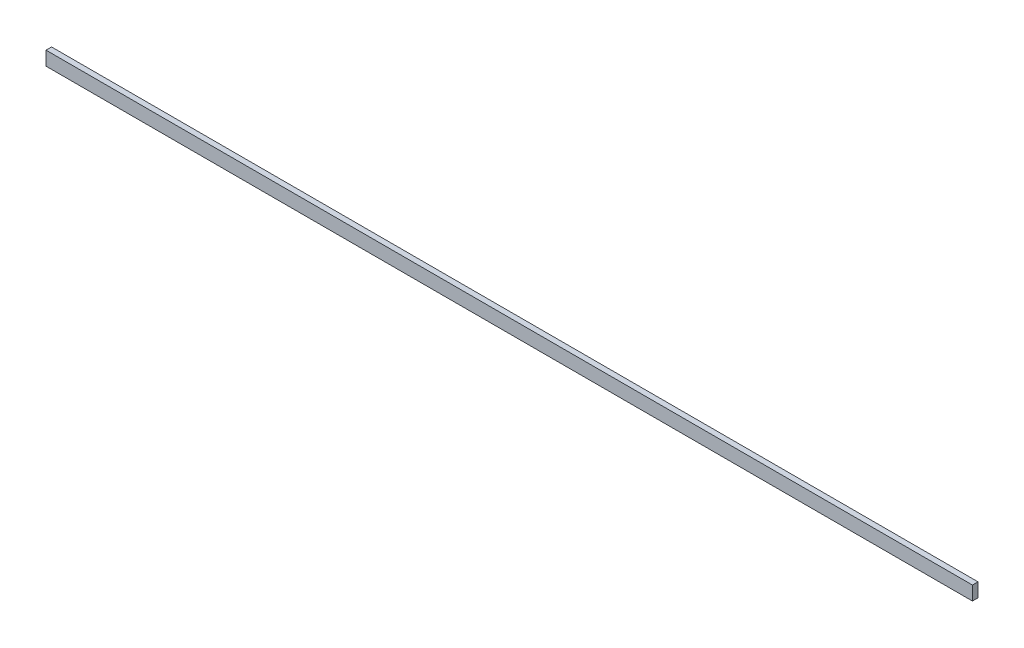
ISO-10303-21;
HEADER;
FILE_DESCRIPTION(('STEP AP214'),'2;1');
FILE_NAME('part.step','',(''),(''),'','','');
FILE_SCHEMA(('AUTOMOTIVE_DESIGN { 1 0 10303 214 1 1 1 1 }'));
ENDSEC;
DATA;
#1=APPLICATION_CONTEXT('core data for automotive mechanical design processes');
#2=APPLICATION_PROTOCOL_DEFINITION('international standard','automotive_design',2000,#1);
#3=PRODUCT_CONTEXT('',#1,'mechanical');
#4=PRODUCT('Part','Part','',(#3));
#5=PRODUCT_RELATED_PRODUCT_CATEGORY('part','',(#4));
#6=PRODUCT_DEFINITION_FORMATION('','',#4);
#7=PRODUCT_DEFINITION_CONTEXT('part definition',#1,'design');
#8=PRODUCT_DEFINITION('design','',#6,#7);
#9=PRODUCT_DEFINITION_SHAPE('','',#8);
#10=(LENGTH_UNIT() NAMED_UNIT(*) SI_UNIT(.MILLI.,.METRE.));
#11=(NAMED_UNIT(*) PLANE_ANGLE_UNIT() SI_UNIT($,.RADIAN.));
#12=(NAMED_UNIT(*) SI_UNIT($,.STERADIAN.) SOLID_ANGLE_UNIT());
#13=UNCERTAINTY_MEASURE_WITH_UNIT(LENGTH_MEASURE(1.E-05),#10,'distance_accuracy_value','');
#14=(GEOMETRIC_REPRESENTATION_CONTEXT(3) GLOBAL_UNCERTAINTY_ASSIGNED_CONTEXT((#13)) GLOBAL_UNIT_ASSIGNED_CONTEXT((#10,
#11,#12)) REPRESENTATION_CONTEXT('',''));
#15=CARTESIAN_POINT('',(0.,0.,0.));
#16=DIRECTION('',(0.,0.,1.));
#17=DIRECTION('',(1.,0.,0.));
#18=AXIS2_PLACEMENT_3D('',#15,#16,#17);
#19=CARTESIAN_POINT('',(0.,0.,12.));
#20=DIRECTION('',(1.,0.,0.));
#21=DIRECTION('',(0.,1.,0.));
#22=AXIS2_PLACEMENT_3D('',#19,#20,#21);
#23=PLANE('',#22);
#24=DIRECTION('',(0.,-1.,0.));
#25=VECTOR('',#24,1.);
#26=CARTESIAN_POINT('',(0.,0.,0.));
#27=LINE('',#26,#25);
#28=CARTESIAN_POINT('',(0.,0.,0.));
#29=VERTEX_POINT('',#28);
#30=CARTESIAN_POINT('',(0.,-30.,0.));
#31=VERTEX_POINT('',#30);
#32=EDGE_CURVE('E96',#29,#31,#27,.T.);
#33=ORIENTED_EDGE('',*,*,#32,.T.);
#34=DIRECTION('',(0.,0.,-1.));
#35=VECTOR('',#34,1.);
#36=CARTESIAN_POINT('',(0.,-30.,12.));
#37=LINE('',#36,#35);
#38=CARTESIAN_POINT('',(0.,-30.,12.));
#39=VERTEX_POINT('',#38);
#40=EDGE_CURVE('E11',#39,#31,#37,.T.);
#41=ORIENTED_EDGE('',*,*,#40,.F.);
#42=DIRECTION('',(0.,-1.,0.));
#43=VECTOR('',#42,1.);
#44=CARTESIAN_POINT('',(0.,0.,12.));
#45=LINE('',#44,#43);
#46=CARTESIAN_POINT('',(0.,0.,12.));
#47=VERTEX_POINT('',#46);
#48=EDGE_CURVE('E84',#47,#39,#45,.T.);
#49=ORIENTED_EDGE('',*,*,#48,.F.);
#50=DIRECTION('',(0.,0.,-1.));
#51=VECTOR('',#50,1.);
#52=CARTESIAN_POINT('',(0.,0.,12.));
#53=LINE('',#52,#51);
#54=EDGE_CURVE('E92',#47,#29,#53,.T.);
#55=ORIENTED_EDGE('',*,*,#54,.T.);
#56=EDGE_LOOP('',(#33,#41,#49,#55));
#57=FACE_BOUND('',#56,.T.);
#58=ADVANCED_FACE('F33',(#57),#23,.F.);
#59=CARTESIAN_POINT('',(0.,-30.,12.));
#60=DIRECTION('',(0.,1.,0.));
#61=DIRECTION('',(0.,0.,1.));
#62=AXIS2_PLACEMENT_3D('',#59,#60,#61);
#63=PLANE('',#62);
#64=DIRECTION('',(1.,0.,0.));
#65=VECTOR('',#64,1.);
#66=CARTESIAN_POINT('',(0.,-30.,0.));
#67=LINE('',#66,#65);
#68=CARTESIAN_POINT('',(2000.,-30.,0.));
#69=VERTEX_POINT('',#68);
#70=EDGE_CURVE('E88',#31,#69,#67,.T.);
#71=ORIENTED_EDGE('',*,*,#70,.T.);
#72=DIRECTION('',(0.,0.,-1.));
#73=VECTOR('',#72,1.);
#74=CARTESIAN_POINT('',(2000.,-30.,12.));
#75=LINE('',#74,#73);
#76=CARTESIAN_POINT('',(2000.,-30.,12.));
#77=VERTEX_POINT('',#76);
#78=EDGE_CURVE('E41',#77,#69,#75,.T.);
#79=ORIENTED_EDGE('',*,*,#78,.F.);
#80=DIRECTION('',(1.,0.,0.));
#81=VECTOR('',#80,1.);
#82=CARTESIAN_POINT('',(0.,-30.,12.));
#83=LINE('',#82,#81);
#84=EDGE_CURVE('E79',#39,#77,#83,.T.);
#85=ORIENTED_EDGE('',*,*,#84,.F.);
#86=ORIENTED_EDGE('',*,*,#40,.T.);
#87=EDGE_LOOP('',(#71,#79,#85,#86));
#88=FACE_BOUND('',#87,.T.);
#89=ADVANCED_FACE('F87',(#88),#63,.F.);
#90=CARTESIAN_POINT('',(2000.,0.,12.));
#91=DIRECTION('',(-1.,0.,0.));
#92=DIRECTION('',(0.,0.,1.));
#93=AXIS2_PLACEMENT_3D('',#90,#91,#92);
#94=PLANE('',#93);
#95=DIRECTION('',(0.,1.,0.));
#96=VECTOR('',#95,1.);
#97=CARTESIAN_POINT('',(2000.,0.,0.));
#98=LINE('',#97,#96);
#99=CARTESIAN_POINT('',(2000.,0.,0.));
#100=VERTEX_POINT('',#99);
#101=EDGE_CURVE('E66',#69,#100,#98,.T.);
#102=ORIENTED_EDGE('',*,*,#101,.T.);
#103=DIRECTION('',(0.,0.,-1.));
#104=VECTOR('',#103,1.);
#105=CARTESIAN_POINT('',(2000.,0.,12.));
#106=LINE('',#105,#104);
#107=CARTESIAN_POINT('',(2000.,0.,12.));
#108=VERTEX_POINT('',#107);
#109=EDGE_CURVE('E89',#108,#100,#106,.T.);
#110=ORIENTED_EDGE('',*,*,#109,.F.);
#111=DIRECTION('',(0.,1.,0.));
#112=VECTOR('',#111,1.);
#113=CARTESIAN_POINT('',(2000.,0.,12.));
#114=LINE('',#113,#112);
#115=EDGE_CURVE('E82',#77,#108,#114,.T.);
#116=ORIENTED_EDGE('',*,*,#115,.F.);
#117=ORIENTED_EDGE('',*,*,#78,.T.);
#118=EDGE_LOOP('',(#102,#110,#116,#117));
#119=FACE_BOUND('',#118,.T.);
#120=ADVANCED_FACE('F90',(#119),#94,.F.);
#121=CARTESIAN_POINT('',(0.,0.,12.));
#122=DIRECTION('',(0.,-1.,0.));
#123=DIRECTION('',(0.,0.,-1.));
#124=AXIS2_PLACEMENT_3D('',#121,#122,#123);
#125=PLANE('',#124);
#126=DIRECTION('',(-1.,0.,0.));
#127=VECTOR('',#126,1.);
#128=CARTESIAN_POINT('',(0.,0.,0.));
#129=LINE('',#128,#127);
#130=EDGE_CURVE('E72',#100,#29,#129,.T.);
#131=ORIENTED_EDGE('',*,*,#130,.T.);
#132=ORIENTED_EDGE('',*,*,#54,.F.);
#133=DIRECTION('',(-1.,0.,0.));
#134=VECTOR('',#133,1.);
#135=CARTESIAN_POINT('',(0.,0.,12.));
#136=LINE('',#135,#134);
#137=EDGE_CURVE('E49',#108,#47,#136,.T.);
#138=ORIENTED_EDGE('',*,*,#137,.F.);
#139=ORIENTED_EDGE('',*,*,#109,.T.);
#140=EDGE_LOOP('',(#131,#132,#138,#139));
#141=FACE_BOUND('',#140,.T.);
#142=ADVANCED_FACE('F103',(#141),#125,.F.);
#143=CARTESIAN_POINT('',(0.,0.,12.));
#144=DIRECTION('',(0.,0.,1.));
#145=DIRECTION('',(1.,0.,0.));
#146=AXIS2_PLACEMENT_3D('',#143,#144,#145);
#147=PLANE('',#146);
#148=ORIENTED_EDGE('',*,*,#48,.T.);
#149=ORIENTED_EDGE('',*,*,#84,.T.);
#150=ORIENTED_EDGE('',*,*,#115,.T.);
#151=ORIENTED_EDGE('',*,*,#137,.T.);
#152=EDGE_LOOP('',(#148,#149,#150,#151));
#153=FACE_BOUND('',#152,.T.);
#154=ADVANCED_FACE('F80',(#153),#147,.T.);
#155=CARTESIAN_POINT('',(0.,0.,0.));
#156=DIRECTION('',(0.,0.,1.));
#157=DIRECTION('',(1.,0.,0.));
#158=AXIS2_PLACEMENT_3D('',#155,#156,#157);
#159=PLANE('',#158);
#160=ORIENTED_EDGE('',*,*,#32,.F.);
#161=ORIENTED_EDGE('',*,*,#130,.F.);
#162=ORIENTED_EDGE('',*,*,#101,.F.);
#163=ORIENTED_EDGE('',*,*,#70,.F.);
#164=EDGE_LOOP('',(#160,#161,#162,#163));
#165=FACE_BOUND('',#164,.T.);
#166=ADVANCED_FACE('F106',(#165),#159,.F.);
#167=CLOSED_SHELL('',(#58,#89,#120,#142,#154,#166));
#168=MANIFOLD_SOLID_BREP('B2',#167);
#169=ADVANCED_BREP_SHAPE_REPRESENTATION('',(#18,#168),#14);
#170=SHAPE_DEFINITION_REPRESENTATION(#9,#169);
ENDSEC;
END-ISO-10303-21;
